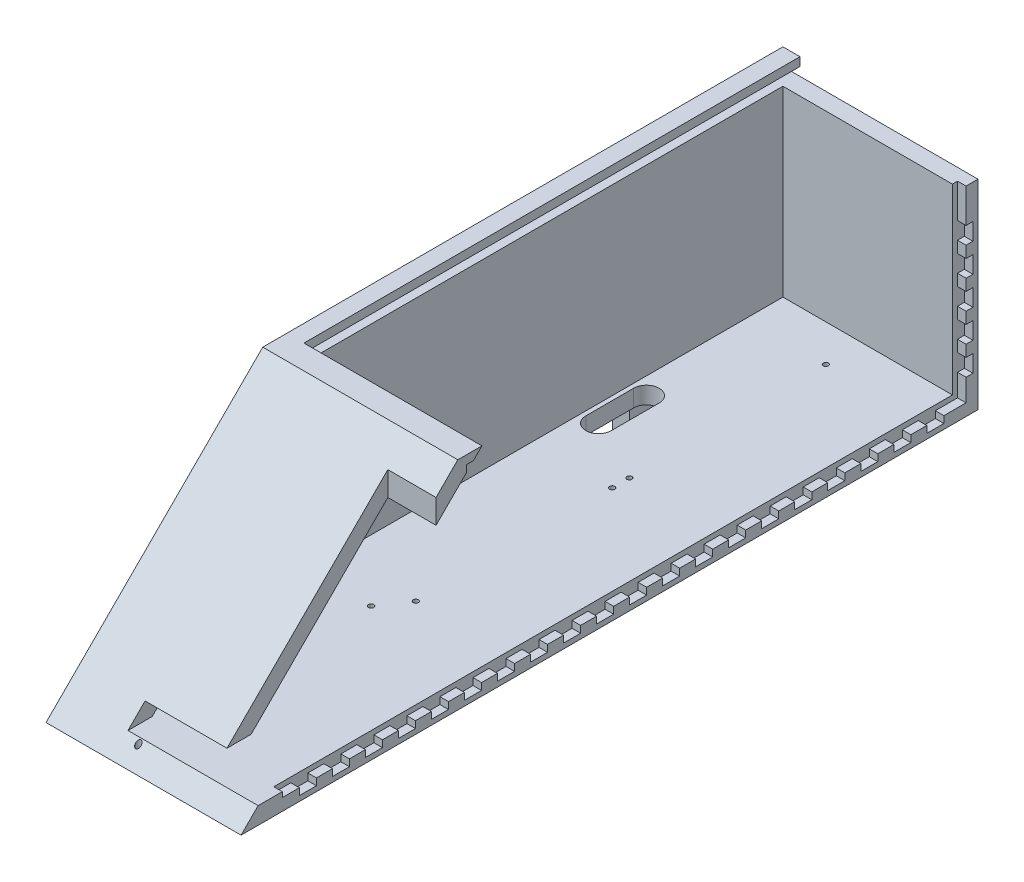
from build123d import *

# Parameters (mm, degrees)
BOSS_EXTRUDE2_DEPTH               = 114.3
SHELL2_T                          = -10
CUT_EXTRUDE2_DEPTH                = 299.8
SKETCH5_W                         = 208.6
SKETCH5_H                         = 5
CUT_EXTRUDE3_DEPTH                = 10
BASE_HOLE_W                       = 152.5
BASE_HOLE_H                       = 152
CUT_EXTRUDE5_DEPTH                = 10
SKETCH16_W                        = 56.5
SKETCH16_H                        = 56.5
CUT_EXTRUDE7_DEPTH                = 120
SKETCH17_W                        = 56.5
SKETCH17_H                        = 47.75
CUT_EXTRUDE8_DEPTH                = 120
SIDEWALL_MOTOR_TABS1_W            = 100
SIDEWALL_MOTOR_TABS1_H            = 30
MOTOR_MOUNT_WALL1_DEPTH           = 10
SIDEWALL_MOTOR_TABS2_W            = 100
SIDEWALL_MOTOR_TABS2_H            = 30
MOTOR_MOUNT_WALL2_DEPTH           = 10
CUT_EXTRUDE_REAR_SLOTS_DEPTH      = 10
CUT_EXTRUDE_FRONT_SLOTS_DEPTH     = 10
SKETCH25_R                        = 3
SKETCH25_R_2                      = 1.55
MOTOR_HOLES_DEPTH                 = 505.815015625
REFERENCE1_BASE_R                 = 1.55
CUT_EXTRUDE9_DEPTH                = 10
SKETCH26_R                        = 1.5
CUT_EXTRUDE_TOWERBASE_HOLES_DEPTH = 10
SKETCH27_W                        = 431.8
SKETCH27_H                        = 157
CUT_EXTRUDE10_DEPTH               = 465.375634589
CUT_EXTRUDE11_DEPTH               = 5
SKETCH31_W                        = 4
SKETCH31_H                        = 10
SKETCH31_W_2                      = 10
SKETCH31_H_2                      = 4
CUT_EXTRUDE12_DEPTH               = 5


with BuildPart() as part:
    # Sketch3 → Boss-Extrude2 (new, symmetric)
    with BuildSketch(Plane(origin=(0, 0, 0), x_dir=(0, 0, -1), z_dir=(1, 0, 0))):
        Polygon((0, 0), (431.8, 0), (431.8, 127), (127, 127), align=None)
    extrude(amount=BOSS_EXTRUDE2_DEPTH, both=True)

    # Shell2
    shell2_openings = [part.faces().sort_by_distance(p)[0] for p in [
        (0, 127, -279.4),
    ]]
    offset(amount=SHELL2_T, openings=shell2_openings, kind=Kind.INTERSECTION)

    # Sketch4 → Cut-Extrude2 (cut)
    with BuildSketch(Plane(origin=(0, 0, -431.8), x_dir=(-1, 0, 0), z_dir=(0, 0, -1))):
        Polygon((-104.3, 122), (-109.3, 122), (-109.3, 117), (-104.3, 117), (104.3, 117), (109.3, 117), (109.3, 122), (104.3, 122), align=None)
    extrude(amount=-CUT_EXTRUDE2_DEPTH, mode=Mode.SUBTRACT)

    # Sketch5 → Cut-Extrude3 (cut)
    with BuildSketch(Plane(origin=(0, 0, -431.8), x_dir=(-1, 0, 0), z_dir=(0, 0, -1))):
        with Locations((0, 124.5)):
            Rectangle(SKETCH5_W, SKETCH5_H)
    extrude(amount=-CUT_EXTRUDE3_DEPTH, mode=Mode.SUBTRACT)

    # Base hole → Cut-Extrude5 (cut)
    with BuildSketch(Plane(origin=(0, 10, 0), x_dir=(1, 0, 0), z_dir=(0, 1, 0))):
        with Locations((0, 86)):
            Rectangle(BASE_HOLE_W, BASE_HOLE_H)
    extrude(amount=CUT_EXTRUDE5_DEPTH, mode=Mode.SUBTRACT)

    # Sketch16 → Cut-Extrude7 (cut)
    with BuildSketch(Plane(origin=(0, 10, 0), x_dir=(1, 0, 0), z_dir=(0, 1, 0))):
        with Locations((0, 86)):
            Rectangle(SKETCH16_W, SKETCH16_H)
    extrude(amount=CUT_EXTRUDE7_DEPTH, mode=Mode.SUBTRACT)

    # Sketch17 → Cut-Extrude8 (cut)
    with BuildSketch(Plane(origin=(0, 10, 0), x_dir=(1, 0, 0), z_dir=(0, 1, 0))):
        with Locations((0, 33.875)):
            Rectangle(SKETCH17_W, SKETCH17_H)
    extrude(amount=CUT_EXTRUDE8_DEPTH, mode=Mode.SUBTRACT)

    # Sidewall_Motor_Tabs1 → Motor_Mount_Wall1 (add)
    with BuildSketch(Plane(origin=(114.3, 0, 0), x_dir=(0, 0, -1), z_dir=(1, 0, 0))):
        Polygon((0, 0), (30, -30), (100, -30), (100, 0), align=None)
        with Locations((381.8, -15)):
            Rectangle(SIDEWALL_MOTOR_TABS1_W, SIDEWALL_MOTOR_TABS1_H)
    extrude(amount=-MOTOR_MOUNT_WALL1_DEPTH)

    # Sidewall_Motor_Tabs2 → Motor_Mount_Wall2 (add)
    with BuildSketch(Plane.ZY.offset(114.3)):
        Polygon((0, 0), (-30, -30), (-100, -30), (-100, 0), align=None)
        with Locations((-381.8, -15)):
            Rectangle(SIDEWALL_MOTOR_TABS2_W, SIDEWALL_MOTOR_TABS2_H)
    extrude(amount=-MOTOR_MOUNT_WALL2_DEPTH)

    # Rear Slots → Cut-Extrude_Rear Slots (cut)
    with BuildSketch(Plane(origin=(0, 10, 0), x_dir=(1, 0, 0), z_dir=(0, 1, 0))):
        with BuildLine():
            Line((-86.8, 331.8), (-86.8, 303.8))
            ThreePointArc((-86.8, 303.8), (-94.3, 296.3), (-101.8, 303.8))
            Line((-101.8, 303.8), (-101.8, 331.8))
            ThreePointArc((-101.8, 331.8), (-94.3, 339.3), (-86.8, 331.8))
        make_face()
        with BuildLine():
            Line((86.8, 331.8), (86.8, 303.8))
            ThreePointArc((86.8, 303.8), (94.3, 296.3), (101.8, 303.8))
            Line((101.8, 303.8), (101.8, 331.8))
            ThreePointArc((101.8, 331.8), (94.3, 339.3), (86.8, 331.8))
        make_face()
    extrude(amount=-CUT_EXTRUDE_REAR_SLOTS_DEPTH, mode=Mode.SUBTRACT)

    # Front Slots → Cut-Extrude_Front Slots (cut)
    with BuildSketch(Plane(origin=(0, 10, 0), x_dir=(1, 0, 0), z_dir=(0, 1, 0))):
        with BuildLine():
            Line((-86.8, 128), (-86.8, 100))
            ThreePointArc((-86.8, 100), (-94.3, 92.5), (-101.8, 100))
            Line((-101.8, 100), (-101.8, 128))
            ThreePointArc((-101.8, 128), (-94.3, 135.5), (-86.8, 128))
        make_face()
        with BuildLine():
            Line((86.8, 128), (86.8, 100))
            ThreePointArc((86.8, 100), (94.3, 92.5), (101.8, 100))
            Line((101.8, 100), (101.8, 128))
            ThreePointArc((101.8, 128), (94.3, 135.5), (86.8, 128))
        make_face()
    extrude(amount=-CUT_EXTRUDE_FRONT_SLOTS_DEPTH, mode=Mode.SUBTRACT)

    # Sketch25 → Motor_Holes (cut, through all)
    with BuildSketch(Plane.ZY.offset(114.3)):
        with Locations((-385.2, -15)):
            Circle(SKETCH25_R)
        with Locations((-365.1, -6.25)):
            Circle(SKETCH25_R_2)
        with Locations((-365.1, -23.75)):
            Circle(SKETCH25_R_2)
        with Locations((-66.7, -23.75)):
            Circle(SKETCH25_R_2)
        with Locations((-66.7, -6.25)):
            Circle(SKETCH25_R_2)
        with Locations((-46.6, -15)):
            Circle(SKETCH25_R)
    extrude(amount=-MOTOR_HOLES_DEPTH, mode=Mode.SUBTRACT)

    # Reference1 Base → Cut-Extrude9 (cut)
    with BuildSketch(Plane.XZ):
        with Locations(Location((-68.2, -144.4, 0), (0, 0, 270))):
            Circle(REFERENCE1_BASE_R)
        with Locations(Location((-68.2, -8, 0), (0, 0, 270))):
            Circle(REFERENCE1_BASE_R)
        with Locations(Location((68.2, -144.4, 0), (0, 0, 90))):
            Circle(REFERENCE1_BASE_R)
        with Locations(Location((68.2, -8, 0), (0, 0, 90))):
            Circle(REFERENCE1_BASE_R)
    extrude(amount=-CUT_EXTRUDE9_DEPTH, mode=Mode.SUBTRACT)

    # Sketch26 → Cut-Extrude_TowerBase_Holes (cut)
    with BuildSketch(Plane.XZ):
        with Locations(Location((-57.54, -159.94, 0), (0, 0, 270))):
            Circle(SKETCH26_R)
        with Locations(Location((57.54, -159.94, 0), (0, 0, 90))):
            Circle(SKETCH26_R)
        with Locations(Location((-57.54, -275.02, 0), (0, 0, 270))):
            Circle(SKETCH26_R)
        with Locations(Location((57.54, -275.02, 0), (0, 0, 90))):
            Circle(SKETCH26_R)
        with Locations(Location((-57.54, -285.1, 0), (0, 0, 270))):
            Circle(SKETCH26_R)
        with Locations(Location((-57.54, -400.18, 0), (0, 0, 270))):
            Circle(SKETCH26_R)
        with Locations(Location((57.54, -285.1, 0), (0, 0, 90))):
            Circle(SKETCH26_R)
        with Locations(Location((57.54, -400.18, 0), (0, 0, 90))):
            Circle(SKETCH26_R)
    extrude(amount=-CUT_EXTRUDE_TOWERBASE_HOLES_DEPTH, mode=Mode.SUBTRACT)

    # Sketch27 → Cut-Extrude10 (cut, through all)
    with BuildSketch(Plane(origin=(0, 0, 0), x_dir=(0, 0, -1), z_dir=(1, 0, 0))):
        with Locations((215.9, 48.5)):
            Rectangle(SKETCH27_W, SKETCH27_H)
    extrude(amount=CUT_EXTRUDE10_DEPTH, mode=Mode.SUBTRACT)

    # Sketch28 → Cut-Extrude11 (cut)
    with BuildSketch(Plane(origin=(0, 0, 0), x_dir=(0, 0, -1), z_dir=(1, 0, 0))):
        Polygon((24.142135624, 10), (421.8, 10), (421.8, 117), (424.8, 117), (424.8, 7), (24.142135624, 7), align=None)
    extrude(amount=-CUT_EXTRUDE11_DEPTH, mode=Mode.SUBTRACT)

    # Sketch31 → Cut-Extrude12 (cut)
    with BuildSketch(Plane(origin=(0, 0, 0), x_dir=(0, 0, -1), z_dir=(1, 0, 0))):
        with Locations((426.8, 25)):
            Rectangle(SKETCH31_W, SKETCH31_H)
        with Locations((406.8, 5)):
            Rectangle(SKETCH31_W_2, SKETCH31_H_2)
        with Locations((387.449586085, 5)):
            Rectangle(SKETCH31_W_2, SKETCH31_H_2)
        with Locations((368.099172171, 5)):
            Rectangle(SKETCH31_W_2, SKETCH31_H_2)
        with Locations((348.748758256, 5)):
            Rectangle(SKETCH31_W_2, SKETCH31_H_2)
        with Locations((329.398344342, 5)):
            Rectangle(SKETCH31_W_2, SKETCH31_H_2)
        with Locations((310.047930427, 5)):
            Rectangle(SKETCH31_W_2, SKETCH31_H_2)
        with Locations((290.697516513, 5)):
            Rectangle(SKETCH31_W_2, SKETCH31_H_2)
        with Locations((271.347102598, 5)):
            Rectangle(SKETCH31_W_2, SKETCH31_H_2)
        with Locations((251.996688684, 5)):
            Rectangle(SKETCH31_W_2, SKETCH31_H_2)
        with Locations((232.646274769, 5)):
            Rectangle(SKETCH31_W_2, SKETCH31_H_2)
        with Locations((213.295860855, 5)):
            Rectangle(SKETCH31_W_2, SKETCH31_H_2)
        with Locations((193.94544694, 5)):
            Rectangle(SKETCH31_W_2, SKETCH31_H_2)
        with Locations((174.595033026, 5)):
            Rectangle(SKETCH31_W_2, SKETCH31_H_2)
        with Locations((155.244619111, 5)):
            Rectangle(SKETCH31_W_2, SKETCH31_H_2)
        with Locations((135.894205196, 5)):
            Rectangle(SKETCH31_W_2, SKETCH31_H_2)
        with Locations((116.543791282, 5)):
            Rectangle(SKETCH31_W_2, SKETCH31_H_2)
        with Locations((97.193377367, 5)):
            Rectangle(SKETCH31_W_2, SKETCH31_H_2)
        with Locations((77.842963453, 5)):
            Rectangle(SKETCH31_W_2, SKETCH31_H_2)
        with Locations((58.492549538, 5)):
            Rectangle(SKETCH31_W_2, SKETCH31_H_2)
        with Locations((39.142135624, 5)):
            Rectangle(SKETCH31_W_2, SKETCH31_H_2)
        with Locations((426.8, 41.75)):
            Rectangle(SKETCH31_W, SKETCH31_H)
        with Locations((426.8, 58.5)):
            Rectangle(SKETCH31_W, SKETCH31_H)
        with Locations((426.8, 75.25)):
            Rectangle(SKETCH31_W, SKETCH31_H)
        with Locations((426.8, 92)):
            Rectangle(SKETCH31_W, SKETCH31_H)
    extrude(amount=-CUT_EXTRUDE12_DEPTH, mode=Mode.SUBTRACT)


solid = part.part
